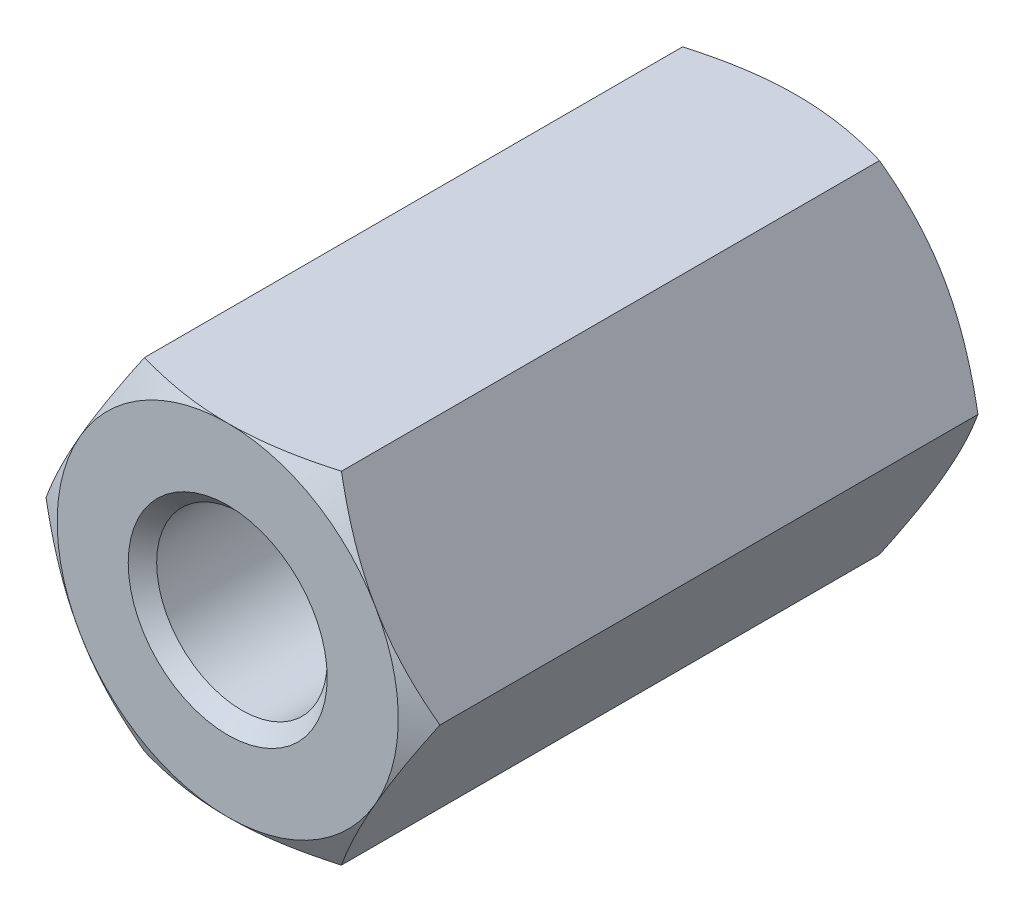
ISO-10303-21;
HEADER;
FILE_DESCRIPTION(('STEP AP214'),'2;1');
FILE_NAME('part.step','',(''),(''),'','','');
FILE_SCHEMA(('AUTOMOTIVE_DESIGN { 1 0 10303 214 1 1 1 1 }'));
ENDSEC;
DATA;
#1=APPLICATION_CONTEXT('core data for automotive mechanical design processes');
#2=APPLICATION_PROTOCOL_DEFINITION('international standard','automotive_design',2000,#1);
#3=PRODUCT_CONTEXT('',#1,'mechanical');
#4=PRODUCT('Part','Part','',(#3));
#5=PRODUCT_RELATED_PRODUCT_CATEGORY('part','',(#4));
#6=PRODUCT_DEFINITION_FORMATION('','',#4);
#7=PRODUCT_DEFINITION_CONTEXT('part definition',#1,'design');
#8=PRODUCT_DEFINITION('design','',#6,#7);
#9=PRODUCT_DEFINITION_SHAPE('','',#8);
#10=(LENGTH_UNIT() NAMED_UNIT(*) SI_UNIT(.MILLI.,.METRE.));
#11=(NAMED_UNIT(*) PLANE_ANGLE_UNIT() SI_UNIT($,.RADIAN.));
#12=(NAMED_UNIT(*) SI_UNIT($,.STERADIAN.) SOLID_ANGLE_UNIT());
#13=UNCERTAINTY_MEASURE_WITH_UNIT(LENGTH_MEASURE(1.E-05),#10,'distance_accuracy_value','');
#14=(GEOMETRIC_REPRESENTATION_CONTEXT(3) GLOBAL_UNCERTAINTY_ASSIGNED_CONTEXT((#13)) GLOBAL_UNIT_ASSIGNED_CONTEXT((#10,
#11,#12)) REPRESENTATION_CONTEXT('',''));
#15=CARTESIAN_POINT('',(0.,0.,0.));
#16=DIRECTION('',(0.,0.,1.));
#17=DIRECTION('',(1.,0.,0.));
#18=AXIS2_PLACEMENT_3D('',#15,#16,#17);
#19=CARTESIAN_POINT('',(3.46410161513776,0.,-5.));
#20=DIRECTION('',(0.866025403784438,0.5,0.));
#21=DIRECTION('',(-0.5,0.866025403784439,0.));
#22=AXIS2_PLACEMENT_3D('',#19,#20,#21);
#23=PLANE('',#22);
#24=CARTESIAN_POINT('',(3.46421708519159,-0.000199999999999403,4.73198413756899));
#25=CARTESIAN_POINT('',(3.38810199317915,0.131635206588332,4.77594629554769));
#26=CARTESIAN_POINT('',(3.31132988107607,0.26460840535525,4.81592841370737));
#27=CARTESIAN_POINT('',(3.15645624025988,0.532857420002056,4.88571791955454));
#28=CARTESIAN_POINT('',(3.078351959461,0.668138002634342,4.91550061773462));
#29=CARTESIAN_POINT('',(2.92311136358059,0.937022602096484,4.96186216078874));
#30=CARTESIAN_POINT('',(2.84599893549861,1.07058524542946,4.97874955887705));
#31=CARTESIAN_POINT('',(2.6914112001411,1.33833905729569,4.99891035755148));
#32=CARTESIAN_POINT('',(2.61393645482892,1.47252925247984,5.00220045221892));
#33=CARTESIAN_POINT('',(2.46916798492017,1.72327559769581,4.99535946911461));
#34=CARTESIAN_POINT('',(2.40185259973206,1.83986926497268,4.98690808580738));
#35=CARTESIAN_POINT('',(2.2676603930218,2.07229698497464,4.96012105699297));
#36=CARTESIAN_POINT('',(2.2007840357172,2.18813023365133,4.94177625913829));
#37=CARTESIAN_POINT('',(2.06631510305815,2.42103725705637,4.89591524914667));
#38=CARTESIAN_POINT('',(1.99873954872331,2.53808155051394,4.86820461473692));
#39=CARTESIAN_POINT('',(1.86459637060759,2.77042435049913,4.8053122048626));
#40=CARTESIAN_POINT('',(1.79802702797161,2.88572583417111,4.77014520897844));
#41=CARTESIAN_POINT('',(1.73193533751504,3.0002,4.73198413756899));
#42=B_SPLINE_CURVE_WITH_KNOTS('',3,(#24,#25,#26,#27,#28,#29,#30,#31,#32,#33,#34,#35,#36,#37,#38,
#39,#40,#41),.UNSPECIFIED.,.F.,.F.,(4,2,2,2,2,2,2,2,4),(0.,0.475539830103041,0.952222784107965,
1.41710776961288,1.88142182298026,2.28572436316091,2.69040156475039,3.10405572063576,
3.5168974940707),.UNSPECIFIED.);
#43=CARTESIAN_POINT('',(3.46410161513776,0.,4.73205080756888));
#44=VERTEX_POINT('',#43);
#45=CARTESIAN_POINT('',(2.59807621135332,1.5,5.));
#46=VERTEX_POINT('',#45);
#47=EDGE_CURVE('E127',#44,#46,#42,.T.);
#48=ORIENTED_EDGE('',*,*,#47,.F.);
#49=DIRECTION('',(0.,0.,1.));
#50=VECTOR('',#49,1.);
#51=CARTESIAN_POINT('',(3.46410161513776,0.,-5.));
#52=LINE('',#51,#50);
#53=CARTESIAN_POINT('',(3.46410161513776,0.,-4.73205080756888));
#54=VERTEX_POINT('',#53);
#55=EDGE_CURVE('E604',#54,#44,#52,.T.);
#56=ORIENTED_EDGE('',*,*,#55,.F.);
#57=CARTESIAN_POINT('',(3.46421708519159,-0.000199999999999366,-4.73198413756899));
#58=CARTESIAN_POINT('',(3.38810199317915,0.131635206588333,-4.77594629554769));
#59=CARTESIAN_POINT('',(3.31132988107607,0.26460840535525,-4.81592841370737));
#60=CARTESIAN_POINT('',(3.15645624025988,0.532857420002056,-4.88571791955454));
#61=CARTESIAN_POINT('',(3.078351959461,0.668138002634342,-4.91550061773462));
#62=CARTESIAN_POINT('',(2.92311136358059,0.937022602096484,-4.96186216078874));
#63=CARTESIAN_POINT('',(2.84599893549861,1.07058524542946,-4.97874955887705));
#64=CARTESIAN_POINT('',(2.6914112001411,1.33833905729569,-4.99891035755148));
#65=CARTESIAN_POINT('',(2.61393645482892,1.47252925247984,-5.00220045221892));
#66=CARTESIAN_POINT('',(2.46916798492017,1.72327559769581,-4.99535946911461));
#67=CARTESIAN_POINT('',(2.40185259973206,1.83986926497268,-4.98690808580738));
#68=CARTESIAN_POINT('',(2.2676603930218,2.07229698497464,-4.96012105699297));
#69=CARTESIAN_POINT('',(2.2007840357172,2.18813023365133,-4.94177625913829));
#70=CARTESIAN_POINT('',(2.06631510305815,2.42103725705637,-4.89591524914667));
#71=CARTESIAN_POINT('',(1.99873954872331,2.53808155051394,-4.86820461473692));
#72=CARTESIAN_POINT('',(1.86459637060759,2.77042435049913,-4.8053122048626));
#73=CARTESIAN_POINT('',(1.79802702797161,2.88572583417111,-4.77014520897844));
#74=CARTESIAN_POINT('',(1.73193533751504,3.0002,-4.73198413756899));
#75=B_SPLINE_CURVE_WITH_KNOTS('',3,(#57,#58,#59,#60,#61,#62,#63,#64,#65,#66,#67,#68,#69,#70,#71,
#72,#73,#74),.UNSPECIFIED.,.F.,.F.,(4,2,2,2,2,2,2,2,4),(0.,0.475539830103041,0.952222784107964,
1.41710776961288,1.88142182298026,2.28572436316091,2.69040156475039,3.10405572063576,
3.5168974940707),.UNSPECIFIED.);
#76=CARTESIAN_POINT('',(2.59807621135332,1.5,-5.));
#77=VERTEX_POINT('',#76);
#78=EDGE_CURVE('E594',#54,#77,#75,.T.);
#79=ORIENTED_EDGE('',*,*,#78,.T.);
#80=CARTESIAN_POINT('',(1.73205080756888,3.,-4.73205080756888));
#81=VERTEX_POINT('',#80);
#82=EDGE_CURVE('E269',#77,#81,#75,.T.);
#83=ORIENTED_EDGE('',*,*,#82,.T.);
#84=DIRECTION('',(0.,0.,1.));
#85=VECTOR('',#84,1.);
#86=CARTESIAN_POINT('',(1.73205080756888,3.,-5.));
#87=LINE('',#86,#85);
#88=CARTESIAN_POINT('',(1.73205080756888,3.,4.73205080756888));
#89=VERTEX_POINT('',#88);
#90=EDGE_CURVE('E159',#81,#89,#87,.T.);
#91=ORIENTED_EDGE('',*,*,#90,.T.);
#92=EDGE_CURVE('E140',#46,#89,#42,.T.);
#93=ORIENTED_EDGE('',*,*,#92,.F.);
#94=EDGE_LOOP('',(#48,#56,#79,#83,#91,#93));
#95=FACE_BOUND('',#94,.T.);
#96=ADVANCED_FACE('F41',(#95),#23,.T.);
#97=CARTESIAN_POINT('',(1.73205080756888,-3.,-5.));
#98=DIRECTION('',(0.866025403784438,-0.5,0.));
#99=DIRECTION('',(0.5,0.866025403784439,0.));
#100=AXIS2_PLACEMENT_3D('',#97,#98,#99);
#101=PLANE('',#100);
#102=CARTESIAN_POINT('',(1.73193533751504,-3.0002,4.73198413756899));
#103=CARTESIAN_POINT('',(1.80805042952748,-2.86836479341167,4.7759462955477));
#104=CARTESIAN_POINT('',(1.88482254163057,-2.73539159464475,4.81592841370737));
#105=CARTESIAN_POINT('',(2.03969618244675,-2.46714257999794,4.88571791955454));
#106=CARTESIAN_POINT('',(2.11780046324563,-2.33186199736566,4.91550061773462));
#107=CARTESIAN_POINT('',(2.27304105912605,-2.06297739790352,4.96186216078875));
#108=CARTESIAN_POINT('',(2.35015348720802,-1.92941475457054,4.97874955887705));
#109=CARTESIAN_POINT('',(2.50474122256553,-1.66166094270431,4.99891035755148));
#110=CARTESIAN_POINT('',(2.58221596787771,-1.52747074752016,5.00220045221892));
#111=CARTESIAN_POINT('',(2.72698443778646,-1.27672440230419,4.99535946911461));
#112=CARTESIAN_POINT('',(2.79429982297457,-1.16013073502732,4.98690808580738));
#113=CARTESIAN_POINT('',(2.92849202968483,-0.927703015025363,4.96012105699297));
#114=CARTESIAN_POINT('',(2.99536838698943,-0.811869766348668,4.94177625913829));
#115=CARTESIAN_POINT('',(3.12983731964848,-0.578962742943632,4.89591524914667));
#116=CARTESIAN_POINT('',(3.19741287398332,-0.461918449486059,4.86820461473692));
#117=CARTESIAN_POINT('',(3.33155605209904,-0.229575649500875,4.8053122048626));
#118=CARTESIAN_POINT('',(3.39812539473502,-0.114274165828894,4.77014520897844));
#119=CARTESIAN_POINT('',(3.46421708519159,0.000200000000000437,4.73198413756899));
#120=B_SPLINE_CURVE_WITH_KNOTS('',3,(#102,#103,#104,#105,#106,#107,#108,#109,#110,#111,#112,
#113,#114,#115,#116,#117,#118,#119),.UNSPECIFIED.,.F.,.F.,(4,2,2,2,2,2,2,2,4),(0.,
0.475539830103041,0.952222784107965,1.41710776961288,1.88142182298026,2.28572436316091,
2.69040156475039,3.10405572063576,3.5168974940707),.UNSPECIFIED.);
#121=CARTESIAN_POINT('',(1.73205080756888,-3.,4.73205080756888));
#122=VERTEX_POINT('',#121);
#123=CARTESIAN_POINT('',(2.59807621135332,-1.5,5.));
#124=VERTEX_POINT('',#123);
#125=EDGE_CURVE('E528',#122,#124,#120,.T.);
#126=ORIENTED_EDGE('',*,*,#125,.F.);
#127=DIRECTION('',(0.,0.,1.));
#128=VECTOR('',#127,1.);
#129=CARTESIAN_POINT('',(1.73205080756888,-3.,-5.));
#130=LINE('',#129,#128);
#131=CARTESIAN_POINT('',(1.73205080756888,-3.,-4.73205080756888));
#132=VERTEX_POINT('',#131);
#133=EDGE_CURVE('E283',#132,#122,#130,.T.);
#134=ORIENTED_EDGE('',*,*,#133,.F.);
#135=CARTESIAN_POINT('',(1.73193533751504,-3.0002,-4.73198413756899));
#136=CARTESIAN_POINT('',(1.80805042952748,-2.86836479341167,-4.7759462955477));
#137=CARTESIAN_POINT('',(1.88482254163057,-2.73539159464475,-4.81592841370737));
#138=CARTESIAN_POINT('',(2.03969618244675,-2.46714257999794,-4.88571791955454));
#139=CARTESIAN_POINT('',(2.11780046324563,-2.33186199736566,-4.91550061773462));
#140=CARTESIAN_POINT('',(2.27304105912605,-2.06297739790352,-4.96186216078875));
#141=CARTESIAN_POINT('',(2.35015348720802,-1.92941475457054,-4.97874955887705));
#142=CARTESIAN_POINT('',(2.50474122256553,-1.66166094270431,-4.99891035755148));
#143=CARTESIAN_POINT('',(2.58221596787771,-1.52747074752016,-5.00220045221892));
#144=CARTESIAN_POINT('',(2.72698443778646,-1.27672440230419,-4.99535946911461));
#145=CARTESIAN_POINT('',(2.79429982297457,-1.16013073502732,-4.98690808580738));
#146=CARTESIAN_POINT('',(2.92849202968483,-0.927703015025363,-4.96012105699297));
#147=CARTESIAN_POINT('',(2.99536838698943,-0.811869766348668,-4.94177625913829));
#148=CARTESIAN_POINT('',(3.12983731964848,-0.578962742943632,-4.89591524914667));
#149=CARTESIAN_POINT('',(3.19741287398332,-0.461918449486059,-4.86820461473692));
#150=CARTESIAN_POINT('',(3.33155605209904,-0.229575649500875,-4.8053122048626));
#151=CARTESIAN_POINT('',(3.39812539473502,-0.114274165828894,-4.77014520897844));
#152=CARTESIAN_POINT('',(3.46421708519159,0.000200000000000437,-4.73198413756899));
#153=B_SPLINE_CURVE_WITH_KNOTS('',3,(#135,#136,#137,#138,#139,#140,#141,#142,#143,#144,#145,
#146,#147,#148,#149,#150,#151,#152),.UNSPECIFIED.,.F.,.F.,(4,2,2,2,2,2,2,2,4),(0.,
0.475539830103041,0.952222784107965,1.41710776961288,1.88142182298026,2.28572436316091,
2.69040156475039,3.10405572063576,3.5168974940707),.UNSPECIFIED.);
#154=CARTESIAN_POINT('',(2.59807621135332,-1.5,-5.));
#155=VERTEX_POINT('',#154);
#156=EDGE_CURVE('E542',#132,#155,#153,.T.);
#157=ORIENTED_EDGE('',*,*,#156,.T.);
#158=EDGE_CURVE('E284',#155,#54,#153,.T.);
#159=ORIENTED_EDGE('',*,*,#158,.T.);
#160=ORIENTED_EDGE('',*,*,#55,.T.);
#161=EDGE_CURVE('E132',#124,#44,#120,.T.);
#162=ORIENTED_EDGE('',*,*,#161,.F.);
#163=EDGE_LOOP('',(#126,#134,#157,#159,#160,#162));
#164=FACE_BOUND('',#163,.T.);
#165=ADVANCED_FACE('F254',(#164),#101,.T.);
#166=CARTESIAN_POINT('',(-1.73205080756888,-3.,-5.));
#167=DIRECTION('',(0.,-1.,0.));
#168=DIRECTION('',(0.,0.,-1.));
#169=AXIS2_PLACEMENT_3D('',#166,#167,#168);
#170=PLANE('',#169);
#171=CARTESIAN_POINT('',(-10.1079133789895,-3.,0.644634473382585));
#172=CARTESIAN_POINT('',(-9.88519326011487,-3.,0.767899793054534));
#173=CARTESIAN_POINT('',(-9.66233896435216,-3.,0.890923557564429));
#174=CARTESIAN_POINT('',(-9.21628967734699,-3.,1.13635712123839));
#175=CARTESIAN_POINT('',(-8.99309468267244,-3.,1.25876691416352));
#176=CARTESIAN_POINT('',(-8.54619999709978,-3.,1.50289171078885));
#177=CARTESIAN_POINT('',(-8.32250013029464,-3.,1.6246063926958));
#178=CARTESIAN_POINT('',(-7.87459549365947,-3.,1.86710155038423));
#179=CARTESIAN_POINT('',(-7.65039072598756,-3.,1.98788203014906));
#180=CARTESIAN_POINT('',(-7.19859019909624,-3.,2.22973857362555));
#181=CARTESIAN_POINT('',(-6.97098661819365,-3.,2.35080004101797));
#182=CARTESIAN_POINT('',(-6.51495389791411,-3.,2.59135751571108));
#183=CARTESIAN_POINT('',(-6.28652476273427,-3.,2.71085353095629));
#184=CARTESIAN_POINT('',(-5.82863894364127,-3.,2.94775447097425));
#185=CARTESIAN_POINT('',(-5.59918246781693,-3.,3.06515979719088));
#186=CARTESIAN_POINT('',(-5.1388595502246,-3.,3.29716865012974));
#187=CARTESIAN_POINT('',(-4.90799314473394,-3.,3.41177224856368));
#188=CARTESIAN_POINT('',(-4.44174717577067,-3.,3.63834356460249));
#189=CARTESIAN_POINT('',(-4.2063460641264,-3.,3.75026707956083));
#190=CARTESIAN_POINT('',(-3.73281071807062,-3.,3.96839546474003));
#191=CARTESIAN_POINT('',(-3.4946758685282,-3.,4.07459901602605));
#192=CARTESIAN_POINT('',(-3.13476684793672,-3.,4.22737320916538));
#193=CARTESIAN_POINT('',(-3.01437606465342,-3.,4.27719793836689));
#194=CARTESIAN_POINT('',(-2.77251256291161,-3.,4.37414009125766));
#195=CARTESIAN_POINT('',(-2.65103990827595,-3.,4.42125767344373));
#196=CARTESIAN_POINT('',(-2.40685760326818,-3.,4.51212187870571));
#197=CARTESIAN_POINT('',(-2.2841481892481,-3.,4.55586913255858));
#198=CARTESIAN_POINT('',(-2.03731754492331,-3.,4.63915506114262));
#199=CARTESIAN_POINT('',(-1.91319646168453,-3.,4.6786941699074));
#200=CARTESIAN_POINT('',(-1.6221773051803,-3.,4.7647272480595));
#201=CARTESIAN_POINT('',(-1.45467224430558,-3.,4.80921411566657));
#202=CARTESIAN_POINT('',(-1.11687818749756,-3.,4.88602951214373));
#203=CARTESIAN_POINT('',(-0.946590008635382,-3.,4.91836154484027));
#204=CARTESIAN_POINT('',(-0.605127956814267,-3.,4.96766677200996));
#205=CARTESIAN_POINT('',(-0.433972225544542,-3.,4.98476141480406));
#206=CARTESIAN_POINT('',(-0.0907996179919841,-3.,5.00201433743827));
#207=CARTESIAN_POINT('',(0.0812171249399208,-3.,5.00217516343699));
#208=CARTESIAN_POINT('',(0.423526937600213,-3.,4.98558899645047));
#209=CARTESIAN_POINT('',(0.593824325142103,-3.,4.9689272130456));
#210=CARTESIAN_POINT('',(0.932301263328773,-3.,4.92077192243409));
#211=CARTESIAN_POINT('',(1.10048016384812,-3.,4.88927397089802));
#212=CARTESIAN_POINT('',(1.35226247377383,-3.,4.83271157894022));
#213=CARTESIAN_POINT('',(1.43690215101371,-3.,4.8120652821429));
#214=CARTESIAN_POINT('',(1.60547426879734,-3.,4.7680497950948));
#215=CARTESIAN_POINT('',(1.68940670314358,-3.,4.7446805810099));
#216=CARTESIAN_POINT('',(1.85656551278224,-3.,4.69557880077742));
#217=CARTESIAN_POINT('',(1.93979194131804,-3.,4.66984641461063));
#218=CARTESIAN_POINT('',(2.10557736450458,-3.,4.61633654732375));
#219=CARTESIAN_POINT('',(2.1881363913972,-3.,4.58855916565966));
#220=CARTESIAN_POINT('',(2.45362474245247,-3.,4.49606809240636));
#221=CARTESIAN_POINT('',(2.63534329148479,-3.,4.42787462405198));
#222=CARTESIAN_POINT('',(2.99632423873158,-3.,4.285238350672));
#223=CARTESIAN_POINT('',(3.17558599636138,-3.,4.21079395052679));
#224=CARTESIAN_POINT('',(3.5322953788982,-3.,4.05729404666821));
#225=CARTESIAN_POINT('',(3.70974133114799,-3.,3.97823467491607));
#226=CARTESIAN_POINT('',(4.06306754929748,-3.,3.81675302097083));
#227=CARTESIAN_POINT('',(4.2389479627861,-3.,3.73433105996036));
#228=CARTESIAN_POINT('',(4.59006547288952,-3.,3.56666857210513));
#229=CARTESIAN_POINT('',(4.76529856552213,-3.,3.48141968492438));
#230=CARTESIAN_POINT('',(5.11479211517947,-3.,3.30894754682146));
#231=CARTESIAN_POINT('',(5.28905255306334,-3.,3.22172425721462));
#232=CARTESIAN_POINT('',(5.8105045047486,-3.,2.95785134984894));
#233=CARTESIAN_POINT('',(6.15653812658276,-3.,2.77891567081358));
#234=CARTESIAN_POINT('',(6.80521231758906,-3.,2.43884097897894));
#235=CARTESIAN_POINT('',(7.10808348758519,-3.,2.27813903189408));
#236=CARTESIAN_POINT('',(7.71271702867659,-3.,1.95456456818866));
#237=CARTESIAN_POINT('',(8.01447924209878,-3.,1.79169175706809));
#238=CARTESIAN_POINT('',(8.61523614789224,-3.,1.46542803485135));
#239=CARTESIAN_POINT('',(8.91423622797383,-3.,1.30204702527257));
#240=CARTESIAN_POINT('',(9.51153886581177,-3.,0.974126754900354));
#241=CARTESIAN_POINT('',(9.80984152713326,-3.,0.809587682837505));
#242=CARTESIAN_POINT('',(10.1079133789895,-3.,0.644634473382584));
#243=B_SPLINE_CURVE_WITH_KNOTS('',3,(#171,#172,#173,#174,#175,#176,#177,#178,#179,#180,#181,
#182,#183,#184,#185,#186,#187,#188,#189,#190,#191,#192,#193,#194,#195,#196,#197,#198,#199,#200,
#201,#202,#203,#204,#205,#206,#207,#208,#209,#210,#211,#212,#213,#214,#215,#216,#217,#218,#219,
#220,#221,#222,#223,#224,#225,#226,#227,#228,#229,#230,#231,#232,#233,#234,#235,#236,#237,#238,
#239,#240,#241,#242),.UNSPECIFIED.,.F.,.F.,(4,2,2,2,2,2,2,2,2,2,2,2,2,2,2,2,2,2,2,2,2,2,2,2,2,2,
2,2,2,2,2,2,2,2,2,4),(0.,0.76366750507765,1.52734275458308,2.29134676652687,3.05534751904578,
3.82873380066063,4.6021161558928,5.37534837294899,6.14856077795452,6.93047841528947,
7.71257558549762,8.10343149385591,8.49426449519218,8.88502417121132,9.2757435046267,
9.79532663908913,10.3147598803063,10.8300150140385,11.3451926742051,11.8577738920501,
12.3705087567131,12.6318377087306,12.8931689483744,13.1544803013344,13.4157789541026,
13.9978701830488,14.5801104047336,15.1628458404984,15.7455257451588,16.3301173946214,
16.9147205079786,18.0833552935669,19.1119403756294,20.1406664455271,21.1628425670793,
22.1848557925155),.UNSPECIFIED.);
#244=CARTESIAN_POINT('',(-1.73205080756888,-3.,4.73205080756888));
#245=VERTEX_POINT('',#244);
#246=CARTESIAN_POINT('',(0.,-3.,5.));
#247=VERTEX_POINT('',#246);
#248=EDGE_CURVE('E529',#245,#247,#243,.T.);
#249=ORIENTED_EDGE('',*,*,#248,.F.);
#250=DIRECTION('',(0.,0.,1.));
#251=VECTOR('',#250,1.);
#252=CARTESIAN_POINT('',(-1.73205080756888,-3.,-5.));
#253=LINE('',#252,#251);
#254=CARTESIAN_POINT('',(-1.73205080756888,-3.,-4.73205080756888));
#255=VERTEX_POINT('',#254);
#256=EDGE_CURVE('E599',#255,#245,#253,.T.);
#257=ORIENTED_EDGE('',*,*,#256,.F.);
#258=CARTESIAN_POINT('',(-7.17784978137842,-3.,-2.24052072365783));
#259=CARTESIAN_POINT('',(-7.01558245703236,-3.,-2.32695100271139));
#260=CARTESIAN_POINT('',(-6.85314037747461,-3.,-2.41305528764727));
#261=CARTESIAN_POINT('',(-6.52782194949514,-3.,-2.584442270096));
#262=CARTESIAN_POINT('',(-6.36494559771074,-3.,-2.66972496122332));
#263=CARTESIAN_POINT('',(-6.03850024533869,-3.,-2.83938935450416));
#264=CARTESIAN_POINT('',(-5.87493068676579,-3.,-2.92376998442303));
#265=CARTESIAN_POINT('',(-5.54716008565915,-3.,-3.09130132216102));
#266=CARTESIAN_POINT('',(-5.38295903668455,-3.,-3.17445201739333));
#267=CARTESIAN_POINT('',(-5.04495709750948,-3.,-3.34363360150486));
#268=CARTESIAN_POINT('',(-4.87111370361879,-3.,-3.42957975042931));
#269=CARTESIAN_POINT('',(-4.5223603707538,-3.,-3.59927115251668));
#270=CARTESIAN_POINT('',(-4.34745046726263,-3.,-3.68301647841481));
#271=CARTESIAN_POINT('',(-3.99636183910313,-3.,-3.84758690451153));
#272=CARTESIAN_POINT('',(-3.8201837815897,-3.,-3.92841342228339));
#273=CARTESIAN_POINT('',(-3.46607843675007,-3.,-4.08623509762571));
#274=CARTESIAN_POINT('',(-3.28815088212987,-3.,-4.16322965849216));
#275=CARTESIAN_POINT('',(-2.91647223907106,-3.,-4.3176583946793));
#276=CARTESIAN_POINT('',(-2.72254790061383,-3.,-4.39467962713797));
#277=CARTESIAN_POINT('',(-2.33152787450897,-3.,-4.54012175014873));
#278=CARTESIAN_POINT('',(-2.13443332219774,-3.,-4.60854564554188));
#279=CARTESIAN_POINT('',(-1.74010191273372,-3.,-4.73196477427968));
#280=CARTESIAN_POINT('',(-1.54293858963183,-3.,-4.78718999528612));
#281=CARTESIAN_POINT('',(-1.14468045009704,-3.,-4.88115539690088));
#282=CARTESIAN_POINT('',(-0.943587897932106,-3.,-4.91990479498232));
#283=CARTESIAN_POINT('',(-0.575005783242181,-3.,-4.97092360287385));
#284=CARTESIAN_POINT('',(-0.408015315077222,-3.,-4.98671427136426));
#285=CARTESIAN_POINT('',(-0.0733262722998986,-3.,-5.00215643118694));
#286=CARTESIAN_POINT('',(0.094372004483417,-3.,-5.00181414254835));
#287=CARTESIAN_POINT('',(0.43190307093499,-3.,-4.98488633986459));
#288=CARTESIAN_POINT('',(0.601721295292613,-3.,-4.96801424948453));
#289=CARTESIAN_POINT('',(0.854800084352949,-3.,-4.93168509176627));
#290=CARTESIAN_POINT('',(0.938905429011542,-3.,-4.91773374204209));
#291=CARTESIAN_POINT('',(1.10649467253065,-3.,-4.88651079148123));
#292=CARTESIAN_POINT('',(1.18997860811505,-3.,-4.86923938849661));
#293=CARTESIAN_POINT('',(1.40884300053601,-3.,-4.81987785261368));
#294=CARTESIAN_POINT('',(1.54366734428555,-3.,-4.78532210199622));
#295=CARTESIAN_POINT('',(1.81152764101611,-3.,-4.70984458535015));
#296=CARTESIAN_POINT('',(1.94456313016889,-3.,-4.66892120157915));
#297=CARTESIAN_POINT('',(2.20914170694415,-3.,-4.58197641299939));
#298=CARTESIAN_POINT('',(2.34068255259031,-3.,-4.53594824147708));
#299=CARTESIAN_POINT('',(2.60227812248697,-3.,-4.43991466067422));
#300=CARTESIAN_POINT('',(2.73233299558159,-3.,-4.38990965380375));
#301=CARTESIAN_POINT('',(2.99202121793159,-3.,-4.28642175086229));
#302=CARTESIAN_POINT('',(3.12164639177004,-3.,-4.23291844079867));
#303=CARTESIAN_POINT('',(3.37982130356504,-3.,-4.12337600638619));
#304=CARTESIAN_POINT('',(3.5083710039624,-3.,-4.06733679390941));
#305=CARTESIAN_POINT('',(3.89248803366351,-3.,-3.89628235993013));
#306=CARTESIAN_POINT('',(4.14671160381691,-3.,-3.77825347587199));
#307=CARTESIAN_POINT('',(4.63589269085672,-3.,-3.54489196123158));
#308=CARTESIAN_POINT('',(4.87101297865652,-3.,-3.4298967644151));
#309=CARTESIAN_POINT('',(5.33966516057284,-3.,-3.19661394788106));
#310=CARTESIAN_POINT('',(5.57319675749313,-3.,-3.07832573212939));
#311=CARTESIAN_POINT('',(6.03578043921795,-3.,-2.84105697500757));
#312=CARTESIAN_POINT('',(6.2648494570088,-3.,-2.72210932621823));
#313=CARTESIAN_POINT('',(6.72200542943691,-3.,-2.48248464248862));
#314=CARTESIAN_POINT('',(6.95009262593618,-3.,-2.36180806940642));
#315=CARTESIAN_POINT('',(7.17784978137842,-3.,-2.24052072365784));
#316=B_SPLINE_CURVE_WITH_KNOTS('',3,(#258,#259,#260,#261,#262,#263,#264,#265,#266,#267,#268,
#269,#270,#271,#272,#273,#274,#275,#276,#277,#278,#279,#280,#281,#282,#283,#284,#285,#286,#287,
#288,#289,#290,#291,#292,#293,#294,#295,#296,#297,#298,#299,#300,#301,#302,#303,#304,#305,#306,
#307,#308,#309,#310,#311,#312,#313,#314,#315),.UNSPECIFIED.,.F.,.F.,(4,2,2,2,2,2,2,2,2,2,2,2,2,
2,2,2,2,2,2,2,2,2,2,2,2,2,2,2,4),(0.,0.551551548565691,1.10310738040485,1.6552587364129,
2.20741573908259,2.78918936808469,3.37094374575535,3.95241167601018,4.53396986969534,
5.15981071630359,5.78543221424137,6.39919323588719,7.01261043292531,7.51510497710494,
8.0174057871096,8.52857189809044,8.78428091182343,9.03997469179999,9.45731092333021,
9.8747533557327,10.2927559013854,10.7107162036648,11.1313814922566,11.5520614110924,
12.3928113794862,13.177990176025,13.9633120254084,14.7376363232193,15.5117574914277),.UNSPECIFIED.);
#317=CARTESIAN_POINT('',(0.,-3.,-5.));
#318=VERTEX_POINT('',#317);
#319=EDGE_CURVE('E606',#255,#318,#316,.T.);
#320=ORIENTED_EDGE('',*,*,#319,.T.);
#321=EDGE_CURVE('E259',#318,#132,#316,.T.);
#322=ORIENTED_EDGE('',*,*,#321,.T.);
#323=ORIENTED_EDGE('',*,*,#133,.T.);
#324=EDGE_CURVE('E138',#247,#122,#243,.T.);
#325=ORIENTED_EDGE('',*,*,#324,.F.);
#326=EDGE_LOOP('',(#249,#257,#320,#322,#323,#325));
#327=FACE_BOUND('',#326,.T.);
#328=ADVANCED_FACE('F292',(#327),#170,.T.);
#329=CARTESIAN_POINT('',(-3.46410161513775,0.,-5.));
#330=DIRECTION('',(-0.866025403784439,-0.5,0.));
#331=DIRECTION('',(0.5,-0.866025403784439,0.));
#332=AXIS2_PLACEMENT_3D('',#329,#330,#331);
#333=PLANE('',#332);
#334=CARTESIAN_POINT('',(-3.46421708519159,0.000200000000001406,4.73198413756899));
#335=CARTESIAN_POINT('',(-3.38810199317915,-0.13163520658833,4.77594629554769));
#336=CARTESIAN_POINT('',(-3.31132988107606,-0.264608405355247,4.81592841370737));
#337=CARTESIAN_POINT('',(-3.15645624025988,-0.532857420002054,4.88571791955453));
#338=CARTESIAN_POINT('',(-3.078351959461,-0.66813800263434,4.91550061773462));
#339=CARTESIAN_POINT('',(-2.92311136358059,-0.937022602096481,4.96186216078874));
#340=CARTESIAN_POINT('',(-2.84599893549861,-1.07058524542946,4.97874955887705));
#341=CARTESIAN_POINT('',(-2.6914112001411,-1.33833905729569,4.99891035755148));
#342=CARTESIAN_POINT('',(-2.61393645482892,-1.47252925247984,5.00220045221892));
#343=CARTESIAN_POINT('',(-2.46916798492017,-1.7232755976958,4.99535946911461));
#344=CARTESIAN_POINT('',(-2.40185259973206,-1.83986926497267,4.98690808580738));
#345=CARTESIAN_POINT('',(-2.2676603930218,-2.07229698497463,4.96012105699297));
#346=CARTESIAN_POINT('',(-2.2007840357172,-2.18813023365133,4.94177625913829));
#347=CARTESIAN_POINT('',(-2.06631510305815,-2.42103725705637,4.89591524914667));
#348=CARTESIAN_POINT('',(-1.99873954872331,-2.53808155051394,4.86820461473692));
#349=CARTESIAN_POINT('',(-1.86459637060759,-2.77042435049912,4.8053122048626));
#350=CARTESIAN_POINT('',(-1.79802702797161,-2.88572583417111,4.77014520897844));
#351=CARTESIAN_POINT('',(-1.73193533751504,-3.0002,4.73198413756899));
#352=B_SPLINE_CURVE_WITH_KNOTS('',3,(#334,#335,#336,#337,#338,#339,#340,#341,#342,#343,#344,
#345,#346,#347,#348,#349,#350,#351),.UNSPECIFIED.,.F.,.F.,(4,2,2,2,2,2,2,2,4),(0.,
0.47553983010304,0.952222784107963,1.41710776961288,1.88142182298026,2.28572436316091,
2.69040156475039,3.10405572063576,3.5168974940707),.UNSPECIFIED.);
#353=CARTESIAN_POINT('',(-3.46410161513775,0.,4.73205080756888));
#354=VERTEX_POINT('',#353);
#355=CARTESIAN_POINT('',(-2.59807621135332,-1.5,5.));
#356=VERTEX_POINT('',#355);
#357=EDGE_CURVE('E176',#354,#356,#352,.T.);
#358=ORIENTED_EDGE('',*,*,#357,.F.);
#359=DIRECTION('',(0.,0.,1.));
#360=VECTOR('',#359,1.);
#361=CARTESIAN_POINT('',(-3.46410161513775,0.,-5.));
#362=LINE('',#361,#360);
#363=CARTESIAN_POINT('',(-3.46410161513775,0.,-4.73205080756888));
#364=VERTEX_POINT('',#363);
#365=EDGE_CURVE('E526',#364,#354,#362,.T.);
#366=ORIENTED_EDGE('',*,*,#365,.F.);
#367=CARTESIAN_POINT('',(-3.46421708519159,0.000200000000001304,-4.73198413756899));
#368=CARTESIAN_POINT('',(-3.38810199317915,-0.13163520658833,-4.7759462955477));
#369=CARTESIAN_POINT('',(-3.31132988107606,-0.264608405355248,-4.81592841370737));
#370=CARTESIAN_POINT('',(-3.15645624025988,-0.532857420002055,-4.88571791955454));
#371=CARTESIAN_POINT('',(-3.078351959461,-0.66813800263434,-4.91550061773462));
#372=CARTESIAN_POINT('',(-2.92311136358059,-0.937022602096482,-4.96186216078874));
#373=CARTESIAN_POINT('',(-2.84599893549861,-1.07058524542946,-4.97874955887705));
#374=CARTESIAN_POINT('',(-2.6914112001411,-1.33833905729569,-4.99891035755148));
#375=CARTESIAN_POINT('',(-2.61393645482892,-1.47252925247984,-5.00220045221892));
#376=CARTESIAN_POINT('',(-2.46916798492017,-1.72327559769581,-4.99535946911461));
#377=CARTESIAN_POINT('',(-2.40185259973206,-1.83986926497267,-4.98690808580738));
#378=CARTESIAN_POINT('',(-2.2676603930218,-2.07229698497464,-4.96012105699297));
#379=CARTESIAN_POINT('',(-2.2007840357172,-2.18813023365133,-4.94177625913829));
#380=CARTESIAN_POINT('',(-2.06631510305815,-2.42103725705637,-4.89591524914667));
#381=CARTESIAN_POINT('',(-1.99873954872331,-2.53808155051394,-4.86820461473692));
#382=CARTESIAN_POINT('',(-1.86459637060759,-2.77042435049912,-4.8053122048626));
#383=CARTESIAN_POINT('',(-1.79802702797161,-2.88572583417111,-4.77014520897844));
#384=CARTESIAN_POINT('',(-1.73193533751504,-3.0002,-4.73198413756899));
#385=B_SPLINE_CURVE_WITH_KNOTS('',3,(#367,#368,#369,#370,#371,#372,#373,#374,#375,#376,#377,
#378,#379,#380,#381,#382,#383,#384),.UNSPECIFIED.,.F.,.F.,(4,2,2,2,2,2,2,2,4),(0.,
0.475539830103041,0.952222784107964,1.41710776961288,1.88142182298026,2.28572436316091,
2.69040156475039,3.10405572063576,3.5168974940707),.UNSPECIFIED.);
#386=CARTESIAN_POINT('',(-2.59807621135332,-1.5,-5.));
#387=VERTEX_POINT('',#386);
#388=EDGE_CURVE('E275',#364,#387,#385,.T.);
#389=ORIENTED_EDGE('',*,*,#388,.T.);
#390=EDGE_CURVE('E282',#387,#255,#385,.T.);
#391=ORIENTED_EDGE('',*,*,#390,.T.);
#392=ORIENTED_EDGE('',*,*,#256,.T.);
#393=EDGE_CURVE('E532',#356,#245,#352,.T.);
#394=ORIENTED_EDGE('',*,*,#393,.F.);
#395=EDGE_LOOP('',(#358,#366,#389,#391,#392,#394));
#396=FACE_BOUND('',#395,.T.);
#397=ADVANCED_FACE('F289',(#396),#333,.T.);
#398=CARTESIAN_POINT('',(-1.73205080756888,3.,-5.));
#399=DIRECTION('',(-0.866025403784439,0.5,0.));
#400=DIRECTION('',(-0.5,-0.866025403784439,0.));
#401=AXIS2_PLACEMENT_3D('',#398,#399,#400);
#402=PLANE('',#401);
#403=CARTESIAN_POINT('',(-1.73193533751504,3.0002,4.73198413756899));
#404=CARTESIAN_POINT('',(-1.80805042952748,2.86836479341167,4.77594629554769));
#405=CARTESIAN_POINT('',(-1.88482254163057,2.73539159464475,4.81592841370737));
#406=CARTESIAN_POINT('',(-2.03969618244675,2.46714257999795,4.88571791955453));
#407=CARTESIAN_POINT('',(-2.11780046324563,2.33186199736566,4.91550061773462));
#408=CARTESIAN_POINT('',(-2.27304105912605,2.06297739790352,4.96186216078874));
#409=CARTESIAN_POINT('',(-2.35015348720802,1.92941475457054,4.97874955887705));
#410=CARTESIAN_POINT('',(-2.50474122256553,1.66166094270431,4.99891035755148));
#411=CARTESIAN_POINT('',(-2.58221596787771,1.52747074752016,5.00220045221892));
#412=CARTESIAN_POINT('',(-2.72698443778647,1.27672440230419,4.99535946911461));
#413=CARTESIAN_POINT('',(-2.79429982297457,1.16013073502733,4.98690808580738));
#414=CARTESIAN_POINT('',(-2.92849202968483,0.927703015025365,4.96012105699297));
#415=CARTESIAN_POINT('',(-2.99536838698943,0.81186976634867,4.94177625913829));
#416=CARTESIAN_POINT('',(-3.12983731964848,0.578962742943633,4.89591524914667));
#417=CARTESIAN_POINT('',(-3.19741287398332,0.46191844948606,4.86820461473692));
#418=CARTESIAN_POINT('',(-3.33155605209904,0.229575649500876,4.8053122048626));
#419=CARTESIAN_POINT('',(-3.39812539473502,0.114274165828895,4.77014520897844));
#420=CARTESIAN_POINT('',(-3.46421708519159,-0.000199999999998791,4.73198413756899));
#421=B_SPLINE_CURVE_WITH_KNOTS('',3,(#403,#404,#405,#406,#407,#408,#409,#410,#411,#412,#413,
#414,#415,#416,#417,#418,#419,#420),.UNSPECIFIED.,.F.,.F.,(4,2,2,2,2,2,2,2,4),(0.,
0.475539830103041,0.952222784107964,1.41710776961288,1.88142182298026,2.28572436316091,
2.69040156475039,3.10405572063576,3.5168974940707),.UNSPECIFIED.);
#422=CARTESIAN_POINT('',(-1.73205080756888,3.,4.73205080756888));
#423=VERTEX_POINT('',#422);
#424=CARTESIAN_POINT('',(-2.59807621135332,1.5,5.));
#425=VERTEX_POINT('',#424);
#426=EDGE_CURVE('E183',#423,#425,#421,.T.);
#427=ORIENTED_EDGE('',*,*,#426,.F.);
#428=DIRECTION('',(0.,0.,1.));
#429=VECTOR('',#428,1.);
#430=CARTESIAN_POINT('',(-1.73205080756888,3.,-5.));
#431=LINE('',#430,#429);
#432=CARTESIAN_POINT('',(-1.73205080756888,3.,-4.73205080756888));
#433=VERTEX_POINT('',#432);
#434=EDGE_CURVE('E233',#433,#423,#431,.T.);
#435=ORIENTED_EDGE('',*,*,#434,.F.);
#436=CARTESIAN_POINT('',(-1.73193533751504,3.0002,-4.73198413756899));
#437=CARTESIAN_POINT('',(-1.80805042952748,2.86836479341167,-4.77594629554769));
#438=CARTESIAN_POINT('',(-1.88482254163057,2.73539159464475,-4.81592841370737));
#439=CARTESIAN_POINT('',(-2.03969618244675,2.46714257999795,-4.88571791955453));
#440=CARTESIAN_POINT('',(-2.11780046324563,2.33186199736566,-4.91550061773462));
#441=CARTESIAN_POINT('',(-2.27304105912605,2.06297739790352,-4.96186216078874));
#442=CARTESIAN_POINT('',(-2.35015348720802,1.92941475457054,-4.97874955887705));
#443=CARTESIAN_POINT('',(-2.50474122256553,1.66166094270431,-4.99891035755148));
#444=CARTESIAN_POINT('',(-2.58221596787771,1.52747074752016,-5.00220045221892));
#445=CARTESIAN_POINT('',(-2.72698443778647,1.27672440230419,-4.99535946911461));
#446=CARTESIAN_POINT('',(-2.79429982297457,1.16013073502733,-4.98690808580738));
#447=CARTESIAN_POINT('',(-2.92849202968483,0.927703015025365,-4.96012105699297));
#448=CARTESIAN_POINT('',(-2.99536838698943,0.81186976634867,-4.94177625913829));
#449=CARTESIAN_POINT('',(-3.12983731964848,0.578962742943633,-4.89591524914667));
#450=CARTESIAN_POINT('',(-3.19741287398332,0.46191844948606,-4.86820461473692));
#451=CARTESIAN_POINT('',(-3.33155605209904,0.229575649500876,-4.8053122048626));
#452=CARTESIAN_POINT('',(-3.39812539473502,0.114274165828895,-4.77014520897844));
#453=CARTESIAN_POINT('',(-3.46421708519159,-0.000199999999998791,-4.73198413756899));
#454=B_SPLINE_CURVE_WITH_KNOTS('',3,(#436,#437,#438,#439,#440,#441,#442,#443,#444,#445,#446,
#447,#448,#449,#450,#451,#452,#453),.UNSPECIFIED.,.F.,.F.,(4,2,2,2,2,2,2,2,4),(0.,
0.475539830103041,0.952222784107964,1.41710776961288,1.88142182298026,2.28572436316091,
2.69040156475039,3.10405572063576,3.5168974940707),.UNSPECIFIED.);
#455=CARTESIAN_POINT('',(-2.59807621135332,1.5,-5.));
#456=VERTEX_POINT('',#455);
#457=EDGE_CURVE('E237',#433,#456,#454,.T.);
#458=ORIENTED_EDGE('',*,*,#457,.T.);
#459=EDGE_CURVE('E598',#456,#364,#454,.T.);
#460=ORIENTED_EDGE('',*,*,#459,.T.);
#461=ORIENTED_EDGE('',*,*,#365,.T.);
#462=EDGE_CURVE('E556',#425,#354,#421,.T.);
#463=ORIENTED_EDGE('',*,*,#462,.F.);
#464=EDGE_LOOP('',(#427,#435,#458,#460,#461,#463));
#465=FACE_BOUND('',#464,.T.);
#466=ADVANCED_FACE('F218',(#465),#402,.T.);
#467=CARTESIAN_POINT('',(1.73205080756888,3.,-5.));
#468=DIRECTION('',(0.,1.,0.));
#469=DIRECTION('',(-1.,0.,0.));
#470=AXIS2_PLACEMENT_3D('',#467,#468,#469);
#471=PLANE('',#470);
#472=CARTESIAN_POINT('',(10.1079133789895,3.,0.644634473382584));
#473=CARTESIAN_POINT('',(9.88519326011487,3.,0.767899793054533));
#474=CARTESIAN_POINT('',(9.66233896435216,3.,0.890923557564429));
#475=CARTESIAN_POINT('',(9.21628967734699,3.,1.13635712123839));
#476=CARTESIAN_POINT('',(8.99309468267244,3.,1.25876691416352));
#477=CARTESIAN_POINT('',(8.54619999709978,3.,1.50289171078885));
#478=CARTESIAN_POINT('',(8.32250013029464,3.,1.6246063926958));
#479=CARTESIAN_POINT('',(7.87459549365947,3.,1.86710155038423));
#480=CARTESIAN_POINT('',(7.65039072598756,3.,1.98788203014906));
#481=CARTESIAN_POINT('',(7.19859019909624,3.,2.22973857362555));
#482=CARTESIAN_POINT('',(6.97098661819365,3.,2.35080004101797));
#483=CARTESIAN_POINT('',(6.51495389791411,3.,2.59135751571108));
#484=CARTESIAN_POINT('',(6.28652476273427,3.,2.71085353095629));
#485=CARTESIAN_POINT('',(5.82863894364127,3.,2.94775447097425));
#486=CARTESIAN_POINT('',(5.59918246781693,3.,3.06515979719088));
#487=CARTESIAN_POINT('',(5.1388595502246,3.,3.29716865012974));
#488=CARTESIAN_POINT('',(4.90799314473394,3.,3.41177224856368));
#489=CARTESIAN_POINT('',(4.44174717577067,3.,3.63834356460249));
#490=CARTESIAN_POINT('',(4.20634606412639,3.,3.75026707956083));
#491=CARTESIAN_POINT('',(3.73281071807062,3.,3.96839546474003));
#492=CARTESIAN_POINT('',(3.49467586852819,3.,4.07459901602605));
#493=CARTESIAN_POINT('',(3.13476684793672,3.,4.22737320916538));
#494=CARTESIAN_POINT('',(3.01437606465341,3.,4.27719793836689));
#495=CARTESIAN_POINT('',(2.7725125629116,3.,4.37414009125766));
#496=CARTESIAN_POINT('',(2.65103990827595,3.,4.42125767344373));
#497=CARTESIAN_POINT('',(2.40685760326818,3.,4.51212187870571));
#498=CARTESIAN_POINT('',(2.28414818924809,3.,4.55586913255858));
#499=CARTESIAN_POINT('',(2.03731754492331,3.,4.63915506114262));
#500=CARTESIAN_POINT('',(1.91319646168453,3.,4.6786941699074));
#501=CARTESIAN_POINT('',(1.6221773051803,3.,4.76472724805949));
#502=CARTESIAN_POINT('',(1.45467224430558,3.,4.80921411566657));
#503=CARTESIAN_POINT('',(1.11687818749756,3.,4.88602951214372));
#504=CARTESIAN_POINT('',(0.946590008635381,3.,4.91836154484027));
#505=CARTESIAN_POINT('',(0.605127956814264,3.,4.96766677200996));
#506=CARTESIAN_POINT('',(0.433972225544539,3.,4.98476141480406));
#507=CARTESIAN_POINT('',(0.0907996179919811,3.,5.00201433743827));
#508=CARTESIAN_POINT('',(-0.0812171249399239,3.,5.00217516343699));
#509=CARTESIAN_POINT('',(-0.423526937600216,3.,4.98558899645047));
#510=CARTESIAN_POINT('',(-0.593824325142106,3.,4.96892721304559));
#511=CARTESIAN_POINT('',(-0.932301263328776,3.,4.92077192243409));
#512=CARTESIAN_POINT('',(-1.10048016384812,3.,4.88927397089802));
#513=CARTESIAN_POINT('',(-1.35226247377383,3.,4.83271157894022));
#514=CARTESIAN_POINT('',(-1.43690215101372,3.,4.81206528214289));
#515=CARTESIAN_POINT('',(-1.60547426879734,3.,4.7680497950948));
#516=CARTESIAN_POINT('',(-1.68940670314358,3.,4.7446805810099));
#517=CARTESIAN_POINT('',(-1.85656551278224,3.,4.69557880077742));
#518=CARTESIAN_POINT('',(-1.93979194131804,3.,4.66984641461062));
#519=CARTESIAN_POINT('',(-2.10557736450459,3.,4.61633654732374));
#520=CARTESIAN_POINT('',(-2.1881363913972,3.,4.58855916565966));
#521=CARTESIAN_POINT('',(-2.45362474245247,3.,4.49606809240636));
#522=CARTESIAN_POINT('',(-2.63534329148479,3.,4.42787462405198));
#523=CARTESIAN_POINT('',(-2.99632423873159,3.,4.285238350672));
#524=CARTESIAN_POINT('',(-3.17558599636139,3.,4.21079395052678));
#525=CARTESIAN_POINT('',(-3.53229537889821,3.,4.05729404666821));
#526=CARTESIAN_POINT('',(-3.70974133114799,3.,3.97823467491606));
#527=CARTESIAN_POINT('',(-4.06306754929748,3.,3.81675302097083));
#528=CARTESIAN_POINT('',(-4.2389479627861,3.,3.73433105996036));
#529=CARTESIAN_POINT('',(-4.59006547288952,3.,3.56666857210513));
#530=CARTESIAN_POINT('',(-4.76529856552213,3.,3.48141968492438));
#531=CARTESIAN_POINT('',(-5.11479211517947,3.,3.30894754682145));
#532=CARTESIAN_POINT('',(-5.28905255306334,3.,3.22172425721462));
#533=CARTESIAN_POINT('',(-5.8105045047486,3.,2.95785134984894));
#534=CARTESIAN_POINT('',(-6.15653812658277,3.,2.77891567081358));
#535=CARTESIAN_POINT('',(-6.80521231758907,3.,2.43884097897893));
#536=CARTESIAN_POINT('',(-7.10808348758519,3.,2.27813903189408));
#537=CARTESIAN_POINT('',(-7.7127170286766,3.,1.95456456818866));
#538=CARTESIAN_POINT('',(-8.01447924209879,3.,1.79169175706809));
#539=CARTESIAN_POINT('',(-8.61523614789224,3.,1.46542803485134));
#540=CARTESIAN_POINT('',(-8.91423622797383,3.,1.30204702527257));
#541=CARTESIAN_POINT('',(-9.51153886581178,3.,0.974126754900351));
#542=CARTESIAN_POINT('',(-9.80984152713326,3.,0.809587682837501));
#543=CARTESIAN_POINT('',(-10.1079133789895,3.,0.644634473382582));
#544=B_SPLINE_CURVE_WITH_KNOTS('',3,(#472,#473,#474,#475,#476,#477,#478,#479,#480,#481,#482,
#483,#484,#485,#486,#487,#488,#489,#490,#491,#492,#493,#494,#495,#496,#497,#498,#499,#500,#501,
#502,#503,#504,#505,#506,#507,#508,#509,#510,#511,#512,#513,#514,#515,#516,#517,#518,#519,#520,
#521,#522,#523,#524,#525,#526,#527,#528,#529,#530,#531,#532,#533,#534,#535,#536,#537,#538,#539,
#540,#541,#542,#543),.UNSPECIFIED.,.F.,.F.,(4,2,2,2,2,2,2,2,2,2,2,2,2,2,2,2,2,2,2,2,2,2,2,2,2,2,
2,2,2,2,2,2,2,2,2,4),(0.,0.763667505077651,1.52734275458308,2.29134676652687,3.05534751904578,
3.82873380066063,4.6021161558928,5.37534837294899,6.14856077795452,6.93047841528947,
7.71257558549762,8.10343149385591,8.49426449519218,8.88502417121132,9.2757435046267,
9.79532663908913,10.3147598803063,10.8300150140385,11.3451926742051,11.8577738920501,
12.3705087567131,12.6318377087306,12.8931689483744,13.1544803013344,13.4157789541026,
13.9978701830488,14.5801104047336,15.1628458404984,15.7455257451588,16.3301173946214,
16.9147205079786,18.0833552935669,19.1119403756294,20.1406664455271,21.1628425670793,
22.1848557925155),.UNSPECIFIED.);
#545=CARTESIAN_POINT('',(0.,3.,5.));
#546=VERTEX_POINT('',#545);
#547=EDGE_CURVE('E145',#89,#546,#544,.T.);
#548=ORIENTED_EDGE('',*,*,#547,.F.);
#549=ORIENTED_EDGE('',*,*,#90,.F.);
#550=CARTESIAN_POINT('',(7.17784978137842,3.,-2.24052072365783));
#551=CARTESIAN_POINT('',(7.01558245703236,3.,-2.32695100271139));
#552=CARTESIAN_POINT('',(6.85314037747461,3.,-2.41305528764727));
#553=CARTESIAN_POINT('',(6.52782194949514,3.,-2.584442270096));
#554=CARTESIAN_POINT('',(6.36494559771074,3.,-2.66972496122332));
#555=CARTESIAN_POINT('',(6.03850024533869,3.,-2.83938935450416));
#556=CARTESIAN_POINT('',(5.87493068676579,3.,-2.92376998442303));
#557=CARTESIAN_POINT('',(5.54716008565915,3.,-3.09130132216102));
#558=CARTESIAN_POINT('',(5.38295903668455,3.,-3.17445201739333));
#559=CARTESIAN_POINT('',(5.04495709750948,3.,-3.34363360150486));
#560=CARTESIAN_POINT('',(4.87111370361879,3.,-3.42957975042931));
#561=CARTESIAN_POINT('',(4.52236037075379,3.,-3.59927115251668));
#562=CARTESIAN_POINT('',(4.34745046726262,3.,-3.68301647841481));
#563=CARTESIAN_POINT('',(3.99636183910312,3.,-3.84758690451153));
#564=CARTESIAN_POINT('',(3.8201837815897,3.,-3.92841342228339));
#565=CARTESIAN_POINT('',(3.46607843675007,3.,-4.08623509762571));
#566=CARTESIAN_POINT('',(3.28815088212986,3.,-4.16322965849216));
#567=CARTESIAN_POINT('',(2.91647223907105,3.,-4.3176583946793));
#568=CARTESIAN_POINT('',(2.72254790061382,3.,-4.39467962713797));
#569=CARTESIAN_POINT('',(2.33152787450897,3.,-4.54012175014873));
#570=CARTESIAN_POINT('',(2.13443332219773,3.,-4.60854564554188));
#571=CARTESIAN_POINT('',(1.74010191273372,3.,-4.73196477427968));
#572=CARTESIAN_POINT('',(1.54293858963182,3.,-4.78718999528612));
#573=CARTESIAN_POINT('',(1.14468045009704,3.,-4.88115539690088));
#574=CARTESIAN_POINT('',(0.943587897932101,3.,-4.91990479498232));
#575=CARTESIAN_POINT('',(0.575005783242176,3.,-4.97092360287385));
#576=CARTESIAN_POINT('',(0.408015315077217,3.,-4.98671427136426));
#577=CARTESIAN_POINT('',(0.0733262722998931,3.,-5.00215643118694));
#578=CARTESIAN_POINT('',(-0.0943720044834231,3.,-5.00181414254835));
#579=CARTESIAN_POINT('',(-0.431903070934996,3.,-4.98488633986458));
#580=CARTESIAN_POINT('',(-0.60172129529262,3.,-4.96801424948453));
#581=CARTESIAN_POINT('',(-0.854800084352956,3.,-4.93168509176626));
#582=CARTESIAN_POINT('',(-0.938905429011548,3.,-4.91773374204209));
#583=CARTESIAN_POINT('',(-1.10649467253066,3.,-4.88651079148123));
#584=CARTESIAN_POINT('',(-1.18997860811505,3.,-4.86923938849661));
#585=CARTESIAN_POINT('',(-1.40884300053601,3.,-4.81987785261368));
#586=CARTESIAN_POINT('',(-1.54366734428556,3.,-4.78532210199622));
#587=CARTESIAN_POINT('',(-1.81152764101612,3.,-4.70984458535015));
#588=CARTESIAN_POINT('',(-1.94456313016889,3.,-4.66892120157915));
#589=CARTESIAN_POINT('',(-2.20914170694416,3.,-4.58197641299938));
#590=CARTESIAN_POINT('',(-2.34068255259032,3.,-4.53594824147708));
#591=CARTESIAN_POINT('',(-2.60227812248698,3.,-4.43991466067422));
#592=CARTESIAN_POINT('',(-2.7323329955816,3.,-4.38990965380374));
#593=CARTESIAN_POINT('',(-2.9920212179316,3.,-4.28642175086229));
#594=CARTESIAN_POINT('',(-3.12164639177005,3.,-4.23291844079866));
#595=CARTESIAN_POINT('',(-3.37982130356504,3.,-4.12337600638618));
#596=CARTESIAN_POINT('',(-3.5083710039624,3.,-4.0673367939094));
#597=CARTESIAN_POINT('',(-3.89248803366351,3.,-3.89628235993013));
#598=CARTESIAN_POINT('',(-4.14671160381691,3.,-3.77825347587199));
#599=CARTESIAN_POINT('',(-4.63589269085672,3.,-3.54489196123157));
#600=CARTESIAN_POINT('',(-4.87101297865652,3.,-3.4298967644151));
#601=CARTESIAN_POINT('',(-5.33966516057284,3.,-3.19661394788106));
#602=CARTESIAN_POINT('',(-5.57319675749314,3.,-3.07832573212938));
#603=CARTESIAN_POINT('',(-6.03578043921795,3.,-2.84105697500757));
#604=CARTESIAN_POINT('',(-6.2648494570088,3.,-2.72210932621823));
#605=CARTESIAN_POINT('',(-6.72200542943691,3.,-2.48248464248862));
#606=CARTESIAN_POINT('',(-6.95009262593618,3.,-2.36180806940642));
#607=CARTESIAN_POINT('',(-7.17784978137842,3.,-2.24052072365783));
#608=B_SPLINE_CURVE_WITH_KNOTS('',3,(#550,#551,#552,#553,#554,#555,#556,#557,#558,#559,#560,
#561,#562,#563,#564,#565,#566,#567,#568,#569,#570,#571,#572,#573,#574,#575,#576,#577,#578,#579,
#580,#581,#582,#583,#584,#585,#586,#587,#588,#589,#590,#591,#592,#593,#594,#595,#596,#597,#598,
#599,#600,#601,#602,#603,#604,#605,#606,#607),.UNSPECIFIED.,.F.,.F.,(4,2,2,2,2,2,2,2,2,2,2,2,2,
2,2,2,2,2,2,2,2,2,2,2,2,2,2,2,4),(0.,0.551551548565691,1.10310738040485,1.6552587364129,
2.20741573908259,2.78918936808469,3.37094374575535,3.95241167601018,4.53396986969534,
5.15981071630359,5.78543221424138,6.39919323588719,7.01261043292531,7.51510497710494,
8.0174057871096,8.52857189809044,8.78428091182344,9.03997469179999,9.45731092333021,
9.87475335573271,10.2927559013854,10.7107162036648,11.1313814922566,11.5520614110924,
12.3928113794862,13.177990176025,13.9633120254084,14.7376363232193,15.5117574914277),.UNSPECIFIED.);
#609=CARTESIAN_POINT('',(0.,3.,-5.));
#610=VERTEX_POINT('',#609);
#611=EDGE_CURVE('E234',#81,#610,#608,.T.);
#612=ORIENTED_EDGE('',*,*,#611,.T.);
#613=EDGE_CURVE('E223',#610,#433,#608,.T.);
#614=ORIENTED_EDGE('',*,*,#613,.T.);
#615=ORIENTED_EDGE('',*,*,#434,.T.);
#616=EDGE_CURVE('E161',#546,#423,#544,.T.);
#617=ORIENTED_EDGE('',*,*,#616,.F.);
#618=EDGE_LOOP('',(#548,#549,#612,#614,#615,#617));
#619=FACE_BOUND('',#618,.T.);
#620=ADVANCED_FACE('F214',(#619),#471,.T.);
#621=CARTESIAN_POINT('',(0.,0.,-5.));
#622=DIRECTION('',(0.,0.,1.));
#623=DIRECTION('',(-1.,0.,0.));
#624=AXIS2_PLACEMENT_3D('',#621,#622,#623);
#625=CONICAL_SURFACE('',#624,3.,1.0471975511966);
#626=CARTESIAN_POINT('',(0.,0.,-5.));
#627=DIRECTION('',(0.,0.,1.));
#628=DIRECTION('',(1.,0.,0.));
#629=AXIS2_PLACEMENT_3D('',#626,#627,#628);
#630=CIRCLE('',#629,3.);
#631=EDGE_CURVE('E549',#155,#77,#630,.T.);
#632=ORIENTED_EDGE('',*,*,#631,.T.);
#633=ORIENTED_EDGE('',*,*,#78,.F.);
#634=ORIENTED_EDGE('',*,*,#158,.F.);
#635=EDGE_LOOP('',(#632,#633,#634));
#636=FACE_BOUND('',#635,.T.);
#637=ADVANCED_FACE('F217',(#636),#625,.T.);
#638=EDGE_CURVE('E546',#318,#155,#630,.T.);
#639=ORIENTED_EDGE('',*,*,#638,.T.);
#640=ORIENTED_EDGE('',*,*,#156,.F.);
#641=ORIENTED_EDGE('',*,*,#321,.F.);
#642=EDGE_LOOP('',(#639,#640,#641));
#643=FACE_BOUND('',#642,.T.);
#644=ADVANCED_FACE('F337',(#643),#625,.T.);
#645=ORIENTED_EDGE('',*,*,#390,.F.);
#646=EDGE_CURVE('E548',#387,#318,#630,.T.);
#647=ORIENTED_EDGE('',*,*,#646,.T.);
#648=ORIENTED_EDGE('',*,*,#319,.F.);
#649=EDGE_LOOP('',(#645,#647,#648));
#650=FACE_BOUND('',#649,.T.);
#651=ADVANCED_FACE('F251',(#650),#625,.T.);
#652=ORIENTED_EDGE('',*,*,#459,.F.);
#653=EDGE_CURVE('E554',#456,#387,#630,.T.);
#654=ORIENTED_EDGE('',*,*,#653,.T.);
#655=ORIENTED_EDGE('',*,*,#388,.F.);
#656=EDGE_LOOP('',(#652,#654,#655));
#657=FACE_BOUND('',#656,.T.);
#658=ADVANCED_FACE('F249',(#657),#625,.T.);
#659=ORIENTED_EDGE('',*,*,#613,.F.);
#660=CARTESIAN_POINT('',(0.,0.,-5.));
#661=DIRECTION('',(0.,0.,-1.));
#662=DIRECTION('',(-1.,0.,0.));
#663=AXIS2_PLACEMENT_3D('',#660,#661,#662);
#664=CIRCLE('',#663,3.);
#665=EDGE_CURVE('E235',#456,#610,#664,.T.);
#666=ORIENTED_EDGE('',*,*,#665,.F.);
#667=ORIENTED_EDGE('',*,*,#457,.F.);
#668=EDGE_LOOP('',(#659,#666,#667));
#669=FACE_BOUND('',#668,.T.);
#670=ADVANCED_FACE('F243',(#669),#625,.T.);
#671=EDGE_CURVE('E551',#77,#610,#630,.T.);
#672=ORIENTED_EDGE('',*,*,#671,.T.);
#673=ORIENTED_EDGE('',*,*,#611,.F.);
#674=ORIENTED_EDGE('',*,*,#82,.F.);
#675=EDGE_LOOP('',(#672,#673,#674));
#676=FACE_BOUND('',#675,.T.);
#677=ADVANCED_FACE('F248',(#676),#625,.T.);
#678=CARTESIAN_POINT('',(0.,0.,-5.));
#679=DIRECTION('',(0.,0.,1.));
#680=DIRECTION('',(1.,0.,0.));
#681=AXIS2_PLACEMENT_3D('',#678,#679,#680);
#682=PLANE('',#681);
#683=CARTESIAN_POINT('',(0.,0.,-5.));
#684=DIRECTION('',(0.,0.,1.));
#685=DIRECTION('',(1.,0.,0.));
#686=AXIS2_PLACEMENT_3D('',#683,#684,#685);
#687=CIRCLE('',#686,1.75);
#688=CARTESIAN_POINT('',(1.75,0.,-5.));
#689=VERTEX_POINT('',#688);
#690=EDGE_CURVE('E576',#689,#689,#687,.T.);
#691=ORIENTED_EDGE('',*,*,#690,.T.);
#692=EDGE_LOOP('',(#691));
#693=FACE_BOUND('',#692,.T.);
#694=ORIENTED_EDGE('',*,*,#671,.F.);
#695=ORIENTED_EDGE('',*,*,#631,.F.);
#696=ORIENTED_EDGE('',*,*,#638,.F.);
#697=ORIENTED_EDGE('',*,*,#646,.F.);
#698=ORIENTED_EDGE('',*,*,#653,.F.);
#699=ORIENTED_EDGE('',*,*,#665,.T.);
#700=EDGE_LOOP('',(#694,#695,#696,#697,#698,#699));
#701=FACE_BOUND('',#700,.T.);
#702=ADVANCED_FACE('F371',(#693,#701),#682,.F.);
#703=CARTESIAN_POINT('',(0.,0.,0.));
#704=DIRECTION('',(0.,0.,-1.));
#705=DIRECTION('',(-1.,0.,0.));
#706=AXIS2_PLACEMENT_3D('',#703,#704,#705);
#707=CYLINDRICAL_SURFACE('',#706,1.5);
#708=CARTESIAN_POINT('',(0.,0.,4.75));
#709=DIRECTION('',(0.,0.,-1.));
#710=DIRECTION('',(-1.,0.,0.));
#711=AXIS2_PLACEMENT_3D('',#708,#709,#710);
#712=CIRCLE('',#711,1.5);
#713=CARTESIAN_POINT('',(-1.5,0.,4.75));
#714=VERTEX_POINT('',#713);
#715=EDGE_CURVE('E12',#714,#714,#712,.F.);
#716=ORIENTED_EDGE('',*,*,#715,.T.);
#717=EDGE_LOOP('',(#716));
#718=FACE_BOUND('',#717,.T.);
#719=CARTESIAN_POINT('',(0.,0.,-4.75));
#720=DIRECTION('',(0.,0.,1.));
#721=DIRECTION('',(1.,0.,0.));
#722=AXIS2_PLACEMENT_3D('',#719,#720,#721);
#723=CIRCLE('',#722,1.5);
#724=CARTESIAN_POINT('',(1.5,0.,-4.75));
#725=VERTEX_POINT('',#724);
#726=EDGE_CURVE('E567',#725,#725,#723,.F.);
#727=ORIENTED_EDGE('',*,*,#726,.T.);
#728=EDGE_LOOP('',(#727));
#729=FACE_BOUND('',#728,.T.);
#730=ADVANCED_FACE('F252',(#718,#729),#707,.F.);
#731=CARTESIAN_POINT('',(0.,0.,-4.75));
#732=DIRECTION('',(0.,0.,-1.));
#733=DIRECTION('',(-1.,0.,0.));
#734=AXIS2_PLACEMENT_3D('',#731,#732,#733);
#735=CONICAL_SURFACE('',#734,1.5,0.785398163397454);
#736=ORIENTED_EDGE('',*,*,#690,.F.);
#737=EDGE_LOOP('',(#736));
#738=FACE_BOUND('',#737,.T.);
#739=ORIENTED_EDGE('',*,*,#726,.F.);
#740=EDGE_LOOP('',(#739));
#741=FACE_BOUND('',#740,.T.);
#742=ADVANCED_FACE('F386',(#738,#741),#735,.F.);
#743=CARTESIAN_POINT('',(0.,0.,5.));
#744=DIRECTION('',(0.,0.,-1.));
#745=DIRECTION('',(-1.,0.,0.));
#746=AXIS2_PLACEMENT_3D('',#743,#744,#745);
#747=CONICAL_SURFACE('',#746,3.,1.0471975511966);
#748=ORIENTED_EDGE('',*,*,#357,.T.);
#749=CARTESIAN_POINT('',(0.,0.,5.));
#750=DIRECTION('',(0.,0.,-1.));
#751=DIRECTION('',(-1.,0.,0.));
#752=AXIS2_PLACEMENT_3D('',#749,#750,#751);
#753=CIRCLE('',#752,3.);
#754=EDGE_CURVE('E149',#425,#356,#753,.F.);
#755=ORIENTED_EDGE('',*,*,#754,.F.);
#756=ORIENTED_EDGE('',*,*,#462,.T.);
#757=EDGE_LOOP('',(#748,#755,#756));
#758=FACE_BOUND('',#757,.T.);
#759=ADVANCED_FACE('F194',(#758),#747,.T.);
#760=ORIENTED_EDGE('',*,*,#426,.T.);
#761=CARTESIAN_POINT('',(0.,0.,5.));
#762=DIRECTION('',(0.,0.,-1.));
#763=DIRECTION('',(-1.,0.,0.));
#764=AXIS2_PLACEMENT_3D('',#761,#762,#763);
#765=CIRCLE('',#764,3.);
#766=EDGE_CURVE('E167',#425,#546,#765,.T.);
#767=ORIENTED_EDGE('',*,*,#766,.T.);
#768=ORIENTED_EDGE('',*,*,#616,.T.);
#769=EDGE_LOOP('',(#760,#767,#768));
#770=FACE_BOUND('',#769,.T.);
#771=ADVANCED_FACE('F191',(#770),#747,.T.);
#772=ORIENTED_EDGE('',*,*,#92,.T.);
#773=ORIENTED_EDGE('',*,*,#547,.T.);
#774=EDGE_CURVE('E59',#46,#546,#753,.F.);
#775=ORIENTED_EDGE('',*,*,#774,.F.);
#776=EDGE_LOOP('',(#772,#773,#775));
#777=FACE_BOUND('',#776,.T.);
#778=ADVANCED_FACE('F143',(#777),#747,.T.);
#779=ORIENTED_EDGE('',*,*,#161,.T.);
#780=ORIENTED_EDGE('',*,*,#47,.T.);
#781=EDGE_CURVE('E129',#124,#46,#753,.F.);
#782=ORIENTED_EDGE('',*,*,#781,.F.);
#783=EDGE_LOOP('',(#779,#780,#782));
#784=FACE_BOUND('',#783,.T.);
#785=ADVANCED_FACE('F128',(#784),#747,.T.);
#786=ORIENTED_EDGE('',*,*,#324,.T.);
#787=ORIENTED_EDGE('',*,*,#125,.T.);
#788=EDGE_CURVE('E154',#247,#124,#753,.F.);
#789=ORIENTED_EDGE('',*,*,#788,.F.);
#790=EDGE_LOOP('',(#786,#787,#789));
#791=FACE_BOUND('',#790,.T.);
#792=ADVANCED_FACE('F420',(#791),#747,.T.);
#793=ORIENTED_EDGE('',*,*,#248,.T.);
#794=EDGE_CURVE('E580',#356,#247,#753,.F.);
#795=ORIENTED_EDGE('',*,*,#794,.F.);
#796=ORIENTED_EDGE('',*,*,#393,.T.);
#797=EDGE_LOOP('',(#793,#795,#796));
#798=FACE_BOUND('',#797,.T.);
#799=ADVANCED_FACE('F196',(#798),#747,.T.);
#800=CARTESIAN_POINT('',(0.,0.,5.));
#801=DIRECTION('',(0.,0.,-1.));
#802=DIRECTION('',(1.,0.,0.));
#803=AXIS2_PLACEMENT_3D('',#800,#801,#802);
#804=PLANE('',#803);
#805=CARTESIAN_POINT('',(0.,0.,5.));
#806=DIRECTION('',(0.,0.,-1.));
#807=DIRECTION('',(-1.,0.,0.));
#808=AXIS2_PLACEMENT_3D('',#805,#806,#807);
#809=CIRCLE('',#808,1.75);
#810=CARTESIAN_POINT('',(-1.75,0.,5.));
#811=VERTEX_POINT('',#810);
#812=EDGE_CURVE('E51',#811,#811,#809,.T.);
#813=ORIENTED_EDGE('',*,*,#812,.T.);
#814=EDGE_LOOP('',(#813));
#815=FACE_BOUND('',#814,.T.);
#816=ORIENTED_EDGE('',*,*,#754,.T.);
#817=ORIENTED_EDGE('',*,*,#794,.T.);
#818=ORIENTED_EDGE('',*,*,#788,.T.);
#819=ORIENTED_EDGE('',*,*,#781,.T.);
#820=ORIENTED_EDGE('',*,*,#774,.T.);
#821=ORIENTED_EDGE('',*,*,#766,.F.);
#822=EDGE_LOOP('',(#816,#817,#818,#819,#820,#821));
#823=FACE_BOUND('',#822,.T.);
#824=ADVANCED_FACE('F151',(#815,#823),#804,.F.);
#825=CARTESIAN_POINT('',(0.,0.,5.));
#826=DIRECTION('',(0.,0.,1.));
#827=DIRECTION('',(1.,0.,0.));
#828=AXIS2_PLACEMENT_3D('',#825,#826,#827);
#829=CONICAL_SURFACE('',#828,1.75,0.785398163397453);
#830=ORIENTED_EDGE('',*,*,#715,.F.);
#831=EDGE_LOOP('',(#830));
#832=FACE_BOUND('',#831,.T.);
#833=ORIENTED_EDGE('',*,*,#812,.F.);
#834=EDGE_LOOP('',(#833));
#835=FACE_BOUND('',#834,.T.);
#836=ADVANCED_FACE('F43',(#832,#835),#829,.F.);
#837=CLOSED_SHELL('',(#96,#165,#328,#397,#466,#620,#637,#644,#651,#658,#670,#677,#702,#730,#742,
#759,#771,#778,#785,#792,#799,#824,#836));
#838=MANIFOLD_SOLID_BREP('B2',#837);
#839=ADVANCED_BREP_SHAPE_REPRESENTATION('',(#18,#838),#14);
#840=SHAPE_DEFINITION_REPRESENTATION(#9,#839);
ENDSEC;
END-ISO-10303-21;
